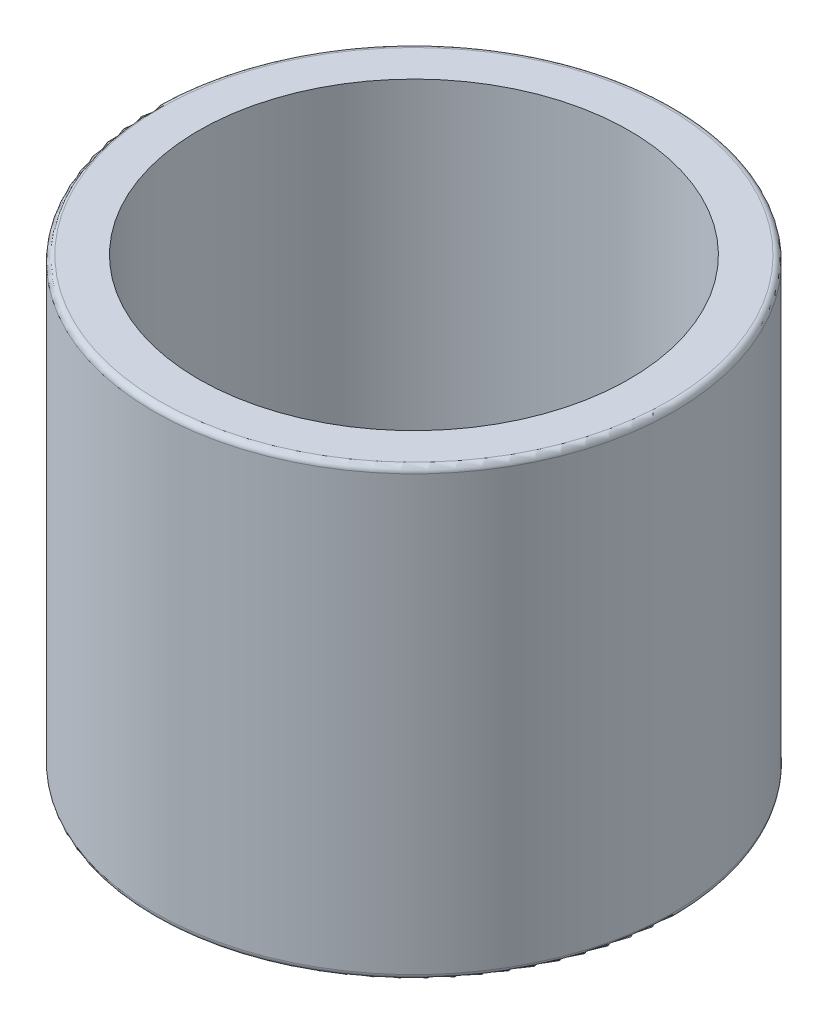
from build123d import *

# Parameters (mm, degrees)
SKETCH1_R           = 17.5
SKETCH1_R_2         = 14.5
BOSS_EXTRUDE1_DEPTH = 30
FILLET1_R           = 0.4


with BuildPart() as part:
    # Sketch1 → Boss-Extrude1 (new body)
    with BuildSketch(Plane(origin=(0, 0, 0), x_dir=(1, 0, 0), z_dir=(0, 1, 0))):
        with Locations(Location((0, 0, 0), (0, 0, 270))):
            Circle(SKETCH1_R)
        with Locations(Location((0, 0, 0), (0, 0, 270))):
            Circle(SKETCH1_R_2, mode=Mode.SUBTRACT)
    extrude(amount=BOSS_EXTRUDE1_DEPTH)

    # Fillet1
    fillet1_edges = [part.edges().sort_by_distance(p)[0] for p in [
        (0, 0, -17.5),
        (0, 30, -17.5),
    ]]
    fillet(fillet1_edges, radius=FILLET1_R)


solid = part.part
